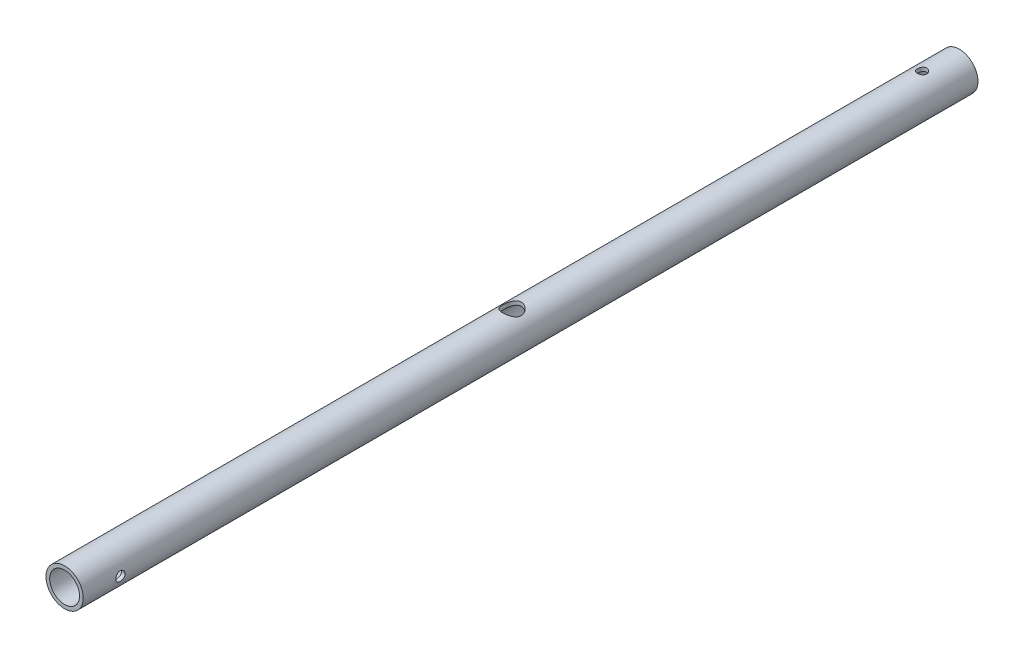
from build123d import *

# Parameters (mm, degrees)
SKETCH2_R               = 12.7
BOSS_EXTRUDE1_DEPTH     = 609.6
SHELL1_T                = -2.54
CUT_EXTRUDE1_DEPTH      = 1219.2
CUT_EXTRUDE1_DEPTH_BACK = 1219.2
SKETCH3_R               = 3.175
SKETCH3_R_2             = 6.35
CUT_EXTRUDE2_DEPTH      = 1219.2
CUT_EXTRUDE2_DEPTH_BACK = 1219.2
SKETCH4_R               = 3.175


with BuildPart() as part:
    # Sketch2 → Boss-Extrude1 (new body)
    with BuildSketch(Plane.XY):
        with Locations(Location((0, 0, 0), (0, 0, 180))):
            Circle(SKETCH2_R)
    extrude(amount=BOSS_EXTRUDE1_DEPTH)

    # Shell1
    shell1_openings = [part.faces().sort_by_distance(p)[0] for p in [
        (0, 0, 609.6),
        (0, 0, 0),
    ]]
    offset(amount=SHELL1_T, openings=shell1_openings, kind=Kind.INTERSECTION)

    # Sketch3 → Cut-Extrude1 (cut, two sides: drawn at the far end of the back side and taken through both)
    with BuildSketch(Plane(origin=(0, 0, 0), x_dir=(1, 0, 0), z_dir=(0, 1, 0)).offset(-CUT_EXTRUDE1_DEPTH_BACK)):
        with Locations(Location((0, -25.4, 0), (0, 0, 90))):
            Circle(SKETCH3_R)
        with Locations(Location((0, -304.8, 0), (0, 0, 90))):
            Circle(SKETCH3_R_2)
    extrude(amount=CUT_EXTRUDE1_DEPTH + CUT_EXTRUDE1_DEPTH_BACK, mode=Mode.SUBTRACT)

    # Sketch4 → Cut-Extrude2 (cut, two sides: drawn at the far end of the back side and taken through both)
    with BuildSketch(Plane(origin=(0, 0, 0), x_dir=(0, 0, -1), z_dir=(1, 0, 0)).offset(-CUT_EXTRUDE2_DEPTH_BACK)):
        with Locations(Location((-584.2, 0, 0), (0, 0, 180))):
            Circle(SKETCH4_R)
    extrude(amount=CUT_EXTRUDE2_DEPTH + CUT_EXTRUDE2_DEPTH_BACK, mode=Mode.SUBTRACT)


solid = part.part
